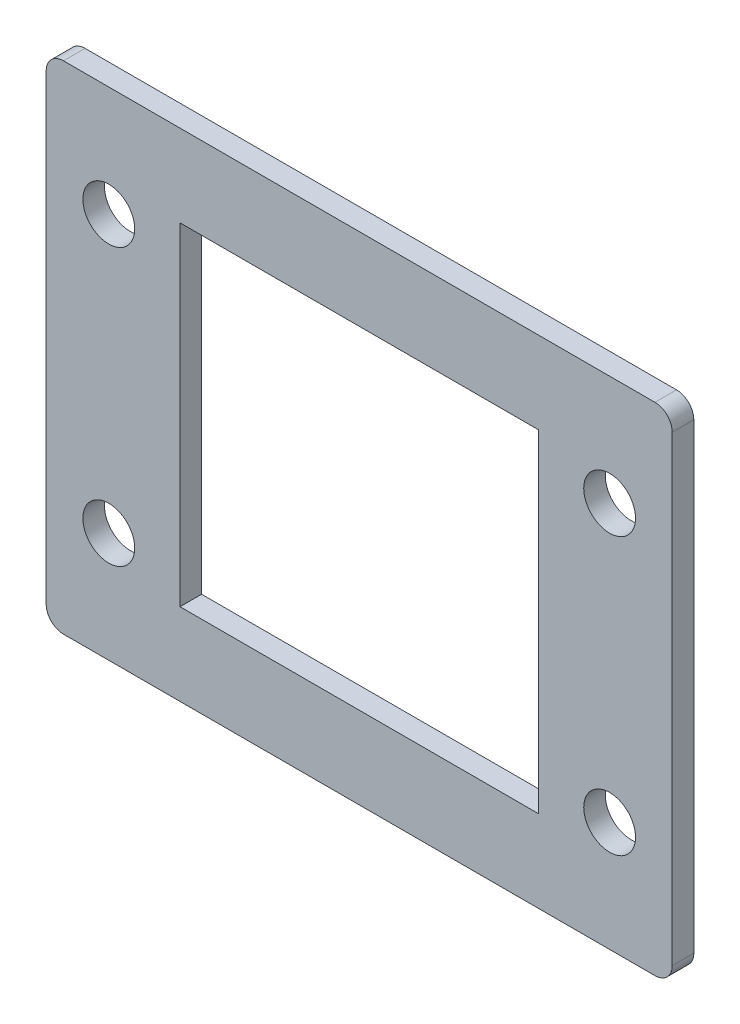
ISO-10303-21;
HEADER;
FILE_DESCRIPTION(('STEP AP214'),'2;1');
FILE_NAME('part.step','',(''),(''),'','','');
FILE_SCHEMA(('AUTOMOTIVE_DESIGN { 1 0 10303 214 1 1 1 1 }'));
ENDSEC;
DATA;
#1=APPLICATION_CONTEXT('core data for automotive mechanical design processes');
#2=APPLICATION_PROTOCOL_DEFINITION('international standard','automotive_design',2000,#1);
#3=PRODUCT_CONTEXT('',#1,'mechanical');
#4=PRODUCT('Part','Part','',(#3));
#5=PRODUCT_RELATED_PRODUCT_CATEGORY('part','',(#4));
#6=PRODUCT_DEFINITION_FORMATION('','',#4);
#7=PRODUCT_DEFINITION_CONTEXT('part definition',#1,'design');
#8=PRODUCT_DEFINITION('design','',#6,#7);
#9=PRODUCT_DEFINITION_SHAPE('','',#8);
#10=(LENGTH_UNIT() NAMED_UNIT(*) SI_UNIT(.MILLI.,.METRE.));
#11=(NAMED_UNIT(*) PLANE_ANGLE_UNIT() SI_UNIT($,.RADIAN.));
#12=(NAMED_UNIT(*) SI_UNIT($,.STERADIAN.) SOLID_ANGLE_UNIT());
#13=UNCERTAINTY_MEASURE_WITH_UNIT(LENGTH_MEASURE(1.E-05),#10,'distance_accuracy_value','');
#14=(GEOMETRIC_REPRESENTATION_CONTEXT(3) GLOBAL_UNCERTAINTY_ASSIGNED_CONTEXT((#13)) GLOBAL_UNIT_ASSIGNED_CONTEXT((#10,
#11,#12)) REPRESENTATION_CONTEXT('',''));
#15=CARTESIAN_POINT('',(0.,0.,0.));
#16=DIRECTION('',(0.,0.,1.));
#17=DIRECTION('',(1.,0.,0.));
#18=AXIS2_PLACEMENT_3D('',#15,#16,#17);
#19=CARTESIAN_POINT('',(-54.1719140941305,41.3391777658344,4.02077910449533));
#20=DIRECTION('',(0.,0.,1.));
#21=DIRECTION('',(1.,0.,0.));
#22=AXIS2_PLACEMENT_3D('',#19,#20,#21);
#23=CYLINDRICAL_SURFACE('',#22,3.);
#24=CARTESIAN_POINT('',(-54.1719140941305,41.3391777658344,12.5060604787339));
#25=DIRECTION('',(0.,0.,1.));
#26=DIRECTION('',(1.,0.,0.));
#27=AXIS2_PLACEMENT_3D('',#24,#25,#26);
#28=CIRCLE('',#27,3.);
#29=CARTESIAN_POINT('',(-51.1719140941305,41.3391777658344,12.5060604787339));
#30=VERTEX_POINT('',#29);
#31=EDGE_CURVE('E263',#30,#30,#28,.T.);
#32=ORIENTED_EDGE('',*,*,#31,.F.);
#33=EDGE_LOOP('',(#32));
#34=FACE_BOUND('',#33,.T.);
#35=CARTESIAN_POINT('',(-54.1719140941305,41.3391777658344,15.0060604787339));
#36=DIRECTION('',(0.,0.,-1.));
#37=DIRECTION('',(-1.,0.,0.));
#38=AXIS2_PLACEMENT_3D('',#35,#36,#37);
#39=CIRCLE('',#38,3.);
#40=CARTESIAN_POINT('',(-57.1719140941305,41.3391777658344,15.0060604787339));
#41=VERTEX_POINT('',#40);
#42=EDGE_CURVE('E34',#41,#41,#39,.T.);
#43=ORIENTED_EDGE('',*,*,#42,.F.);
#44=EDGE_LOOP('',(#43));
#45=FACE_BOUND('',#44,.T.);
#46=ADVANCED_FACE('F15',(#34,#45),#23,.F.);
#47=CARTESIAN_POINT('',(3.82808590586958,41.3391777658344,4.02077910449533));
#48=DIRECTION('',(0.,0.,1.));
#49=DIRECTION('',(1.,0.,0.));
#50=AXIS2_PLACEMENT_3D('',#47,#48,#49);
#51=CYLINDRICAL_SURFACE('',#50,3.);
#52=CARTESIAN_POINT('',(3.82808590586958,41.3391777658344,12.5060604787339));
#53=DIRECTION('',(0.,0.,1.));
#54=DIRECTION('',(1.,0.,0.));
#55=AXIS2_PLACEMENT_3D('',#52,#53,#54);
#56=CIRCLE('',#55,3.);
#57=CARTESIAN_POINT('',(6.82808590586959,41.3391777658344,12.5060604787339));
#58=VERTEX_POINT('',#57);
#59=EDGE_CURVE('E258',#58,#58,#56,.T.);
#60=ORIENTED_EDGE('',*,*,#59,.F.);
#61=EDGE_LOOP('',(#60));
#62=FACE_BOUND('',#61,.T.);
#63=CARTESIAN_POINT('',(3.82808590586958,41.3391777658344,15.0060604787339));
#64=DIRECTION('',(0.,0.,-1.));
#65=DIRECTION('',(-1.,0.,0.));
#66=AXIS2_PLACEMENT_3D('',#63,#64,#65);
#67=CIRCLE('',#66,3.);
#68=CARTESIAN_POINT('',(0.828085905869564,41.3391777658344,15.0060604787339));
#69=VERTEX_POINT('',#68);
#70=EDGE_CURVE('E187',#69,#69,#67,.T.);
#71=ORIENTED_EDGE('',*,*,#70,.F.);
#72=EDGE_LOOP('',(#71));
#73=FACE_BOUND('',#72,.T.);
#74=ADVANCED_FACE('F293',(#62,#73),#51,.F.);
#75=CARTESIAN_POINT('',(-59.4219140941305,52.0891777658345,12.5060604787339));
#76=DIRECTION('',(0.,0.,1.));
#77=DIRECTION('',(1.,0.,0.));
#78=AXIS2_PLACEMENT_3D('',#75,#76,#77);
#79=CYLINDRICAL_SURFACE('',#78,2.);
#80=CARTESIAN_POINT('',(-59.4219140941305,52.0891777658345,12.5060604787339));
#81=DIRECTION('',(0.,0.,-1.));
#82=DIRECTION('',(1.,0.,0.));
#83=AXIS2_PLACEMENT_3D('',#80,#81,#82);
#84=CIRCLE('',#83,2.);
#85=CARTESIAN_POINT('',(-61.4219140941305,52.0891777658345,12.5060604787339));
#86=VERTEX_POINT('',#85);
#87=CARTESIAN_POINT('',(-59.4219140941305,54.0891777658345,12.5060604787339));
#88=VERTEX_POINT('',#87);
#89=EDGE_CURVE('E244',#86,#88,#84,.T.);
#90=ORIENTED_EDGE('',*,*,#89,.F.);
#91=DIRECTION('',(0.,0.,-1.));
#92=VECTOR('',#91,1.);
#93=CARTESIAN_POINT('',(-61.4219140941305,52.0891777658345,12.5060604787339));
#94=LINE('',#93,#92);
#95=CARTESIAN_POINT('',(-61.4219140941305,52.0891777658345,15.0060604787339));
#96=VERTEX_POINT('',#95);
#97=EDGE_CURVE('E215',#96,#86,#94,.T.);
#98=ORIENTED_EDGE('',*,*,#97,.F.);
#99=CARTESIAN_POINT('',(-59.4219140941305,52.0891777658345,15.0060604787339));
#100=DIRECTION('',(0.,0.,1.));
#101=DIRECTION('',(1.,0.,0.));
#102=AXIS2_PLACEMENT_3D('',#99,#100,#101);
#103=CIRCLE('',#102,2.);
#104=CARTESIAN_POINT('',(-59.4219140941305,54.0891777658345,15.0060604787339));
#105=VERTEX_POINT('',#104);
#106=EDGE_CURVE('E270',#105,#96,#103,.T.);
#107=ORIENTED_EDGE('',*,*,#106,.F.);
#108=DIRECTION('',(0.,0.,1.));
#109=VECTOR('',#108,1.);
#110=CARTESIAN_POINT('',(-59.4219140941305,54.0891777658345,12.5060604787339));
#111=LINE('',#110,#109);
#112=EDGE_CURVE('E221',#88,#105,#111,.T.);
#113=ORIENTED_EDGE('',*,*,#112,.F.);
#114=EDGE_LOOP('',(#90,#98,#107,#113));
#115=FACE_BOUND('',#114,.T.);
#116=ADVANCED_FACE('F295',(#115),#79,.T.);
#117=CARTESIAN_POINT('',(-59.4219140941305,-1.41082223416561,12.5060604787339));
#118=DIRECTION('',(0.,0.,1.));
#119=DIRECTION('',(1.,0.,0.));
#120=AXIS2_PLACEMENT_3D('',#117,#118,#119);
#121=CYLINDRICAL_SURFACE('',#120,2.);
#122=CARTESIAN_POINT('',(-59.4219140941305,-1.41082223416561,12.5060604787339));
#123=DIRECTION('',(0.,0.,-1.));
#124=DIRECTION('',(1.,0.,0.));
#125=AXIS2_PLACEMENT_3D('',#122,#123,#124);
#126=CIRCLE('',#125,2.);
#127=CARTESIAN_POINT('',(-59.4219140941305,-3.41082223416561,12.5060604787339));
#128=VERTEX_POINT('',#127);
#129=CARTESIAN_POINT('',(-61.4219140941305,-1.41082223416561,12.5060604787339));
#130=VERTEX_POINT('',#129);
#131=EDGE_CURVE('E530',#128,#130,#126,.T.);
#132=ORIENTED_EDGE('',*,*,#131,.F.);
#133=DIRECTION('',(0.,0.,-1.));
#134=VECTOR('',#133,1.);
#135=CARTESIAN_POINT('',(-59.4219140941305,-3.41082223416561,12.5060604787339));
#136=LINE('',#135,#134);
#137=CARTESIAN_POINT('',(-59.4219140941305,-3.41082223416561,15.0060604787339));
#138=VERTEX_POINT('',#137);
#139=EDGE_CURVE('E209',#138,#128,#136,.T.);
#140=ORIENTED_EDGE('',*,*,#139,.F.);
#141=CARTESIAN_POINT('',(-59.4219140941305,-1.41082223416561,15.0060604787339));
#142=DIRECTION('',(0.,0.,1.));
#143=DIRECTION('',(1.,0.,0.));
#144=AXIS2_PLACEMENT_3D('',#141,#142,#143);
#145=CIRCLE('',#144,2.);
#146=CARTESIAN_POINT('',(-61.4219140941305,-1.41082223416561,15.0060604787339));
#147=VERTEX_POINT('',#146);
#148=EDGE_CURVE('E276',#147,#138,#145,.T.);
#149=ORIENTED_EDGE('',*,*,#148,.F.);
#150=DIRECTION('',(0.,0.,1.));
#151=VECTOR('',#150,1.);
#152=CARTESIAN_POINT('',(-61.4219140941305,-1.41082223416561,12.5060604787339));
#153=LINE('',#152,#151);
#154=EDGE_CURVE('E212',#130,#147,#153,.T.);
#155=ORIENTED_EDGE('',*,*,#154,.F.);
#156=EDGE_LOOP('',(#132,#140,#149,#155));
#157=FACE_BOUND('',#156,.T.);
#158=ADVANCED_FACE('F302',(#157),#121,.T.);
#159=CARTESIAN_POINT('',(9.0780859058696,-1.41082223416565,12.5060604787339));
#160=DIRECTION('',(0.,0.,1.));
#161=DIRECTION('',(1.,0.,0.));
#162=AXIS2_PLACEMENT_3D('',#159,#160,#161);
#163=CYLINDRICAL_SURFACE('',#162,2.);
#164=CARTESIAN_POINT('',(9.0780859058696,-1.41082223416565,12.5060604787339));
#165=DIRECTION('',(0.,0.,-1.));
#166=DIRECTION('',(1.,0.,0.));
#167=AXIS2_PLACEMENT_3D('',#164,#165,#166);
#168=CIRCLE('',#167,2.);
#169=CARTESIAN_POINT('',(11.0780859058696,-1.41082223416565,12.5060604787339));
#170=VERTEX_POINT('',#169);
#171=CARTESIAN_POINT('',(9.0780859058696,-3.41082223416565,12.5060604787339));
#172=VERTEX_POINT('',#171);
#173=EDGE_CURVE('E540',#170,#172,#168,.T.);
#174=ORIENTED_EDGE('',*,*,#173,.F.);
#175=DIRECTION('',(0.,0.,-1.));
#176=VECTOR('',#175,1.);
#177=CARTESIAN_POINT('',(11.0780859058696,-1.41082223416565,12.5060604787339));
#178=LINE('',#177,#176);
#179=CARTESIAN_POINT('',(11.0780859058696,-1.41082223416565,15.0060604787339));
#180=VERTEX_POINT('',#179);
#181=EDGE_CURVE('E203',#180,#170,#178,.T.);
#182=ORIENTED_EDGE('',*,*,#181,.F.);
#183=CARTESIAN_POINT('',(9.0780859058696,-1.41082223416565,15.0060604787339));
#184=DIRECTION('',(0.,0.,1.));
#185=DIRECTION('',(1.,0.,0.));
#186=AXIS2_PLACEMENT_3D('',#183,#184,#185);
#187=CIRCLE('',#186,2.);
#188=CARTESIAN_POINT('',(9.0780859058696,-3.41082223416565,15.0060604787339));
#189=VERTEX_POINT('',#188);
#190=EDGE_CURVE('E284',#189,#180,#187,.T.);
#191=ORIENTED_EDGE('',*,*,#190,.F.);
#192=DIRECTION('',(0.,0.,1.));
#193=VECTOR('',#192,1.);
#194=CARTESIAN_POINT('',(9.0780859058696,-3.41082223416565,12.5060604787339));
#195=LINE('',#194,#193);
#196=EDGE_CURVE('E206',#172,#189,#195,.T.);
#197=ORIENTED_EDGE('',*,*,#196,.F.);
#198=EDGE_LOOP('',(#174,#182,#191,#197));
#199=FACE_BOUND('',#198,.T.);
#200=ADVANCED_FACE('F310',(#199),#163,.T.);
#201=CARTESIAN_POINT('',(9.07808590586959,52.0891777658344,12.5060604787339));
#202=DIRECTION('',(0.,0.,1.));
#203=DIRECTION('',(1.,0.,0.));
#204=AXIS2_PLACEMENT_3D('',#201,#202,#203);
#205=CYLINDRICAL_SURFACE('',#204,2.);
#206=CARTESIAN_POINT('',(9.07808590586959,52.0891777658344,12.5060604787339));
#207=DIRECTION('',(0.,0.,-1.));
#208=DIRECTION('',(1.,0.,0.));
#209=AXIS2_PLACEMENT_3D('',#206,#207,#208);
#210=CIRCLE('',#209,2.);
#211=CARTESIAN_POINT('',(9.07808590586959,54.0891777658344,12.5060604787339));
#212=VERTEX_POINT('',#211);
#213=CARTESIAN_POINT('',(11.0780859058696,52.0891777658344,12.5060604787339));
#214=VERTEX_POINT('',#213);
#215=EDGE_CURVE('E522',#212,#214,#210,.T.);
#216=ORIENTED_EDGE('',*,*,#215,.F.);
#217=DIRECTION('',(0.,0.,-1.));
#218=VECTOR('',#217,1.);
#219=CARTESIAN_POINT('',(9.07808590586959,54.0891777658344,12.5060604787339));
#220=LINE('',#219,#218);
#221=CARTESIAN_POINT('',(9.07808590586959,54.0891777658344,15.0060604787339));
#222=VERTEX_POINT('',#221);
#223=EDGE_CURVE('E218',#222,#212,#220,.T.);
#224=ORIENTED_EDGE('',*,*,#223,.F.);
#225=CARTESIAN_POINT('',(9.07808590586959,52.0891777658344,15.0060604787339));
#226=DIRECTION('',(0.,0.,1.));
#227=DIRECTION('',(1.,0.,0.));
#228=AXIS2_PLACEMENT_3D('',#225,#226,#227);
#229=CIRCLE('',#228,2.);
#230=CARTESIAN_POINT('',(11.0780859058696,52.0891777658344,15.0060604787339));
#231=VERTEX_POINT('',#230);
#232=EDGE_CURVE('E271',#231,#222,#229,.T.);
#233=ORIENTED_EDGE('',*,*,#232,.F.);
#234=DIRECTION('',(0.,0.,1.));
#235=VECTOR('',#234,1.);
#236=CARTESIAN_POINT('',(11.0780859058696,52.0891777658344,12.5060604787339));
#237=LINE('',#236,#235);
#238=EDGE_CURVE('E200',#214,#231,#237,.T.);
#239=ORIENTED_EDGE('',*,*,#238,.F.);
#240=EDGE_LOOP('',(#216,#224,#233,#239));
#241=FACE_BOUND('',#240,.T.);
#242=ADVANCED_FACE('F314',(#241),#205,.T.);
#243=CARTESIAN_POINT('',(-54.1719140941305,9.3391777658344,-44.1022427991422));
#244=DIRECTION('',(0.,0.,1.));
#245=DIRECTION('',(1.,0.,0.));
#246=AXIS2_PLACEMENT_3D('',#243,#244,#245);
#247=CYLINDRICAL_SURFACE('',#246,3.);
#248=CARTESIAN_POINT('',(-54.1719140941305,9.3391777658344,12.5060604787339));
#249=DIRECTION('',(0.,0.,1.));
#250=DIRECTION('',(1.,0.,0.));
#251=AXIS2_PLACEMENT_3D('',#248,#249,#250);
#252=CIRCLE('',#251,3.);
#253=CARTESIAN_POINT('',(-51.1719140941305,9.3391777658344,12.5060604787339));
#254=VERTEX_POINT('',#253);
#255=EDGE_CURVE('E255',#254,#254,#252,.T.);
#256=ORIENTED_EDGE('',*,*,#255,.F.);
#257=EDGE_LOOP('',(#256));
#258=FACE_BOUND('',#257,.T.);
#259=CARTESIAN_POINT('',(-54.1719140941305,9.3391777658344,15.0060604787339));
#260=DIRECTION('',(0.,0.,-1.));
#261=DIRECTION('',(1.,0.,0.));
#262=AXIS2_PLACEMENT_3D('',#259,#260,#261);
#263=CIRCLE('',#262,3.);
#264=CARTESIAN_POINT('',(-51.1719140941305,9.3391777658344,15.0060604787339));
#265=VERTEX_POINT('',#264);
#266=EDGE_CURVE('E195',#265,#265,#263,.T.);
#267=ORIENTED_EDGE('',*,*,#266,.F.);
#268=EDGE_LOOP('',(#267));
#269=FACE_BOUND('',#268,.T.);
#270=ADVANCED_FACE('F318',(#258,#269),#247,.F.);
#271=CARTESIAN_POINT('',(3.82808590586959,9.33917776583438,-44.1022427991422));
#272=DIRECTION('',(0.,0.,1.));
#273=DIRECTION('',(1.,0.,0.));
#274=AXIS2_PLACEMENT_3D('',#271,#272,#273);
#275=CYLINDRICAL_SURFACE('',#274,3.);
#276=CARTESIAN_POINT('',(3.82808590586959,9.33917776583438,12.5060604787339));
#277=DIRECTION('',(0.,0.,1.));
#278=DIRECTION('',(1.,0.,0.));
#279=AXIS2_PLACEMENT_3D('',#276,#277,#278);
#280=CIRCLE('',#279,3.);
#281=CARTESIAN_POINT('',(6.82808590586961,9.33917776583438,12.5060604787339));
#282=VERTEX_POINT('',#281);
#283=EDGE_CURVE('E252',#282,#282,#280,.T.);
#284=ORIENTED_EDGE('',*,*,#283,.F.);
#285=EDGE_LOOP('',(#284));
#286=FACE_BOUND('',#285,.T.);
#287=CARTESIAN_POINT('',(3.82808590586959,9.33917776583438,15.0060604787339));
#288=DIRECTION('',(0.,0.,-1.));
#289=DIRECTION('',(-1.,0.,0.));
#290=AXIS2_PLACEMENT_3D('',#287,#288,#289);
#291=CIRCLE('',#290,3.);
#292=CARTESIAN_POINT('',(0.828085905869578,9.33917776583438,15.0060604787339));
#293=VERTEX_POINT('',#292);
#294=EDGE_CURVE('E183',#293,#293,#291,.T.);
#295=ORIENTED_EDGE('',*,*,#294,.F.);
#296=EDGE_LOOP('',(#295));
#297=FACE_BOUND('',#296,.T.);
#298=ADVANCED_FACE('F322',(#286,#297),#275,.F.);
#299=CARTESIAN_POINT('',(-4.42191409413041,6.08917776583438,-44.1022427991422));
#300=DIRECTION('',(-1.,0.,0.));
#301=DIRECTION('',(0.,-1.,0.));
#302=AXIS2_PLACEMENT_3D('',#299,#300,#301);
#303=PLANE('',#302);
#304=DIRECTION('',(0.,0.,1.));
#305=VECTOR('',#304,1.);
#306=CARTESIAN_POINT('',(-4.42191409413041,6.08917776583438,-44.1022427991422));
#307=LINE('',#306,#305);
#308=CARTESIAN_POINT('',(-4.42191409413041,6.08917776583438,12.5060604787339));
#309=VERTEX_POINT('',#308);
#310=CARTESIAN_POINT('',(-4.42191409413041,6.08917776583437,15.0060604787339));
#311=VERTEX_POINT('',#310);
#312=EDGE_CURVE('E10',#309,#311,#307,.T.);
#313=ORIENTED_EDGE('',*,*,#312,.T.);
#314=DIRECTION('',(0.,-1.,0.));
#315=VECTOR('',#314,1.);
#316=CARTESIAN_POINT('',(-4.42191409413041,6.08917776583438,15.0060604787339));
#317=LINE('',#316,#315);
#318=CARTESIAN_POINT('',(-4.42191409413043,44.5891777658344,15.0060604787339));
#319=VERTEX_POINT('',#318);
#320=EDGE_CURVE('E175',#319,#311,#317,.T.);
#321=ORIENTED_EDGE('',*,*,#320,.F.);
#322=DIRECTION('',(0.,0.,1.));
#323=VECTOR('',#322,1.);
#324=CARTESIAN_POINT('',(-4.42191409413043,44.5891777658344,-44.1022427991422));
#325=LINE('',#324,#323);
#326=CARTESIAN_POINT('',(-4.42191409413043,44.5891777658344,12.5060604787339));
#327=VERTEX_POINT('',#326);
#328=EDGE_CURVE('E165',#327,#319,#325,.T.);
#329=ORIENTED_EDGE('',*,*,#328,.F.);
#330=DIRECTION('',(0.,1.,0.));
#331=VECTOR('',#330,1.);
#332=CARTESIAN_POINT('',(-4.42191409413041,6.08917776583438,12.5060604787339));
#333=LINE('',#332,#331);
#334=EDGE_CURVE('E234',#309,#327,#333,.T.);
#335=ORIENTED_EDGE('',*,*,#334,.F.);
#336=EDGE_LOOP('',(#313,#321,#329,#335));
#337=FACE_BOUND('',#336,.T.);
#338=ADVANCED_FACE('F326',(#337),#303,.T.);
#339=CARTESIAN_POINT('',(-4.42191409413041,6.08917776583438,-44.1022427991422));
#340=DIRECTION('',(0.,1.,0.));
#341=DIRECTION('',(-1.,0.,0.));
#342=AXIS2_PLACEMENT_3D('',#339,#340,#341);
#343=PLANE('',#342);
#344=DIRECTION('',(0.,0.,1.));
#345=VECTOR('',#344,1.);
#346=CARTESIAN_POINT('',(-45.9219140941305,6.0891777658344,-44.1022427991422));
#347=LINE('',#346,#345);
#348=CARTESIAN_POINT('',(-45.9219140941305,6.0891777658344,12.5060604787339));
#349=VERTEX_POINT('',#348);
#350=CARTESIAN_POINT('',(-45.9219140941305,6.0891777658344,15.0060604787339));
#351=VERTEX_POINT('',#350);
#352=EDGE_CURVE('E24',#349,#351,#347,.T.);
#353=ORIENTED_EDGE('',*,*,#352,.T.);
#354=DIRECTION('',(-1.,0.,0.));
#355=VECTOR('',#354,1.);
#356=CARTESIAN_POINT('',(-4.42191409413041,6.08917776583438,15.0060604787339));
#357=LINE('',#356,#355);
#358=EDGE_CURVE('E181',#311,#351,#357,.T.);
#359=ORIENTED_EDGE('',*,*,#358,.F.);
#360=ORIENTED_EDGE('',*,*,#312,.F.);
#361=DIRECTION('',(1.,0.,0.));
#362=VECTOR('',#361,1.);
#363=CARTESIAN_POINT('',(-4.42191409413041,6.08917776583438,12.5060604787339));
#364=LINE('',#363,#362);
#365=EDGE_CURVE('E229',#349,#309,#364,.T.);
#366=ORIENTED_EDGE('',*,*,#365,.F.);
#367=EDGE_LOOP('',(#353,#359,#360,#366));
#368=FACE_BOUND('',#367,.T.);
#369=ADVANCED_FACE('F227',(#368),#343,.T.);
#370=CARTESIAN_POINT('',(-45.9219140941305,6.0891777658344,-44.1022427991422));
#371=DIRECTION('',(1.,0.,0.));
#372=DIRECTION('',(0.,0.,-1.));
#373=AXIS2_PLACEMENT_3D('',#370,#371,#372);
#374=PLANE('',#373);
#375=DIRECTION('',(0.,0.,1.));
#376=VECTOR('',#375,1.);
#377=CARTESIAN_POINT('',(-45.9219140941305,44.5891777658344,-44.1022427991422));
#378=LINE('',#377,#376);
#379=CARTESIAN_POINT('',(-45.9219140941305,44.5891777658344,12.5060604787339));
#380=VERTEX_POINT('',#379);
#381=CARTESIAN_POINT('',(-45.9219140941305,44.5891777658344,15.0060604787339));
#382=VERTEX_POINT('',#381);
#383=EDGE_CURVE('E154',#380,#382,#378,.T.);
#384=ORIENTED_EDGE('',*,*,#383,.T.);
#385=DIRECTION('',(0.,1.,0.));
#386=VECTOR('',#385,1.);
#387=CARTESIAN_POINT('',(-45.9219140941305,6.0891777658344,15.0060604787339));
#388=LINE('',#387,#386);
#389=EDGE_CURVE('E158',#351,#382,#388,.T.);
#390=ORIENTED_EDGE('',*,*,#389,.F.);
#391=ORIENTED_EDGE('',*,*,#352,.F.);
#392=DIRECTION('',(0.,-1.,0.));
#393=VECTOR('',#392,1.);
#394=CARTESIAN_POINT('',(-45.9219140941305,6.0891777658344,12.5060604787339));
#395=LINE('',#394,#393);
#396=EDGE_CURVE('E160',#380,#349,#395,.T.);
#397=ORIENTED_EDGE('',*,*,#396,.F.);
#398=EDGE_LOOP('',(#384,#390,#391,#397));
#399=FACE_BOUND('',#398,.T.);
#400=ADVANCED_FACE('F156',(#399),#374,.T.);
#401=CARTESIAN_POINT('',(-4.42191409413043,44.5891777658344,-44.1022427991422));
#402=DIRECTION('',(0.,-1.,0.));
#403=DIRECTION('',(1.,0.,0.));
#404=AXIS2_PLACEMENT_3D('',#401,#402,#403);
#405=PLANE('',#404);
#406=ORIENTED_EDGE('',*,*,#328,.T.);
#407=DIRECTION('',(1.,0.,0.));
#408=VECTOR('',#407,1.);
#409=CARTESIAN_POINT('',(-4.42191409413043,44.5891777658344,15.0060604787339));
#410=LINE('',#409,#408);
#411=EDGE_CURVE('E168',#382,#319,#410,.T.);
#412=ORIENTED_EDGE('',*,*,#411,.F.);
#413=ORIENTED_EDGE('',*,*,#383,.F.);
#414=DIRECTION('',(-1.,0.,0.));
#415=VECTOR('',#414,1.);
#416=CARTESIAN_POINT('',(-4.42191409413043,44.5891777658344,12.5060604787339));
#417=LINE('',#416,#415);
#418=EDGE_CURVE('E238',#327,#380,#417,.T.);
#419=ORIENTED_EDGE('',*,*,#418,.F.);
#420=EDGE_LOOP('',(#406,#412,#413,#419));
#421=FACE_BOUND('',#420,.T.);
#422=ADVANCED_FACE('F169',(#421),#405,.T.);
#423=CARTESIAN_POINT('',(11.0780859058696,54.0891777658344,12.5060604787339));
#424=DIRECTION('',(0.,-1.,0.));
#425=DIRECTION('',(1.,0.,0.));
#426=AXIS2_PLACEMENT_3D('',#423,#424,#425);
#427=PLANE('',#426);
#428=DIRECTION('',(1.,0.,0.));
#429=VECTOR('',#428,1.);
#430=CARTESIAN_POINT('',(11.0780859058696,54.0891777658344,15.0060604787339));
#431=LINE('',#430,#429);
#432=EDGE_CURVE('E266',#105,#222,#431,.T.);
#433=ORIENTED_EDGE('',*,*,#432,.T.);
#434=ORIENTED_EDGE('',*,*,#223,.T.);
#435=DIRECTION('',(1.,0.,0.));
#436=VECTOR('',#435,1.);
#437=CARTESIAN_POINT('',(11.0780859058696,54.0891777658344,12.5060604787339));
#438=LINE('',#437,#436);
#439=EDGE_CURVE('E514',#88,#212,#438,.T.);
#440=ORIENTED_EDGE('',*,*,#439,.F.);
#441=ORIENTED_EDGE('',*,*,#112,.T.);
#442=EDGE_LOOP('',(#433,#434,#440,#441));
#443=FACE_BOUND('',#442,.T.);
#444=ADVANCED_FACE('F337',(#443),#427,.F.);
#445=CARTESIAN_POINT('',(-61.4219140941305,-3.41082223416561,12.5060604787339));
#446=DIRECTION('',(1.,0.,0.));
#447=DIRECTION('',(0.,1.,0.));
#448=AXIS2_PLACEMENT_3D('',#445,#446,#447);
#449=PLANE('',#448);
#450=DIRECTION('',(0.,1.,0.));
#451=VECTOR('',#450,1.);
#452=CARTESIAN_POINT('',(-61.4219140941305,-3.41082223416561,12.5060604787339));
#453=LINE('',#452,#451);
#454=EDGE_CURVE('E517',#130,#86,#453,.T.);
#455=ORIENTED_EDGE('',*,*,#454,.F.);
#456=ORIENTED_EDGE('',*,*,#154,.T.);
#457=DIRECTION('',(0.,1.,0.));
#458=VECTOR('',#457,1.);
#459=CARTESIAN_POINT('',(-61.4219140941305,-3.41082223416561,15.0060604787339));
#460=LINE('',#459,#458);
#461=EDGE_CURVE('E275',#147,#96,#460,.T.);
#462=ORIENTED_EDGE('',*,*,#461,.T.);
#463=ORIENTED_EDGE('',*,*,#97,.T.);
#464=EDGE_LOOP('',(#455,#456,#462,#463));
#465=FACE_BOUND('',#464,.T.);
#466=ADVANCED_FACE('F335',(#465),#449,.F.);
#467=CARTESIAN_POINT('',(11.0780859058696,-3.41082223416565,12.5060604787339));
#468=DIRECTION('',(0.,1.,0.));
#469=DIRECTION('',(-1.,0.,0.));
#470=AXIS2_PLACEMENT_3D('',#467,#468,#469);
#471=PLANE('',#470);
#472=DIRECTION('',(-1.,0.,0.));
#473=VECTOR('',#472,1.);
#474=CARTESIAN_POINT('',(11.0780859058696,-3.41082223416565,12.5060604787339));
#475=LINE('',#474,#473);
#476=EDGE_CURVE('E531',#172,#128,#475,.T.);
#477=ORIENTED_EDGE('',*,*,#476,.F.);
#478=ORIENTED_EDGE('',*,*,#196,.T.);
#479=DIRECTION('',(-1.,0.,0.));
#480=VECTOR('',#479,1.);
#481=CARTESIAN_POINT('',(11.0780859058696,-3.41082223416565,15.0060604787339));
#482=LINE('',#481,#480);
#483=EDGE_CURVE('E280',#189,#138,#482,.T.);
#484=ORIENTED_EDGE('',*,*,#483,.T.);
#485=ORIENTED_EDGE('',*,*,#139,.T.);
#486=EDGE_LOOP('',(#477,#478,#484,#485));
#487=FACE_BOUND('',#486,.T.);
#488=ADVANCED_FACE('F331',(#487),#471,.F.);
#489=CARTESIAN_POINT('',(11.0780859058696,-3.41082223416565,12.5060604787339));
#490=DIRECTION('',(-1.,0.,0.));
#491=DIRECTION('',(0.,1.,0.));
#492=AXIS2_PLACEMENT_3D('',#489,#490,#491);
#493=PLANE('',#492);
#494=DIRECTION('',(0.,-1.,0.));
#495=VECTOR('',#494,1.);
#496=CARTESIAN_POINT('',(11.0780859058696,-3.41082223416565,12.5060604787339));
#497=LINE('',#496,#495);
#498=EDGE_CURVE('E527',#214,#170,#497,.T.);
#499=ORIENTED_EDGE('',*,*,#498,.F.);
#500=ORIENTED_EDGE('',*,*,#238,.T.);
#501=DIRECTION('',(0.,-1.,0.));
#502=VECTOR('',#501,1.);
#503=CARTESIAN_POINT('',(11.0780859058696,-3.41082223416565,15.0060604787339));
#504=LINE('',#503,#502);
#505=EDGE_CURVE('E247',#231,#180,#504,.T.);
#506=ORIENTED_EDGE('',*,*,#505,.T.);
#507=ORIENTED_EDGE('',*,*,#181,.T.);
#508=EDGE_LOOP('',(#499,#500,#506,#507));
#509=FACE_BOUND('',#508,.T.);
#510=ADVANCED_FACE('F334',(#509),#493,.F.);
#511=CARTESIAN_POINT('',(11.0780859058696,54.0891777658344,15.0060604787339));
#512=DIRECTION('',(0.,0.,1.));
#513=DIRECTION('',(0.,-1.,0.));
#514=AXIS2_PLACEMENT_3D('',#511,#512,#513);
#515=PLANE('',#514);
#516=ORIENTED_EDGE('',*,*,#42,.T.);
#517=EDGE_LOOP('',(#516));
#518=FACE_BOUND('',#517,.T.);
#519=ORIENTED_EDGE('',*,*,#266,.T.);
#520=EDGE_LOOP('',(#519));
#521=FACE_BOUND('',#520,.T.);
#522=ORIENTED_EDGE('',*,*,#389,.T.);
#523=ORIENTED_EDGE('',*,*,#411,.T.);
#524=ORIENTED_EDGE('',*,*,#320,.T.);
#525=ORIENTED_EDGE('',*,*,#358,.T.);
#526=EDGE_LOOP('',(#522,#523,#524,#525));
#527=FACE_BOUND('',#526,.T.);
#528=ORIENTED_EDGE('',*,*,#294,.T.);
#529=EDGE_LOOP('',(#528));
#530=FACE_BOUND('',#529,.T.);
#531=ORIENTED_EDGE('',*,*,#70,.T.);
#532=EDGE_LOOP('',(#531));
#533=FACE_BOUND('',#532,.T.);
#534=ORIENTED_EDGE('',*,*,#505,.F.);
#535=ORIENTED_EDGE('',*,*,#232,.T.);
#536=ORIENTED_EDGE('',*,*,#432,.F.);
#537=ORIENTED_EDGE('',*,*,#106,.T.);
#538=ORIENTED_EDGE('',*,*,#461,.F.);
#539=ORIENTED_EDGE('',*,*,#148,.T.);
#540=ORIENTED_EDGE('',*,*,#483,.F.);
#541=ORIENTED_EDGE('',*,*,#190,.T.);
#542=EDGE_LOOP('',(#534,#535,#536,#537,#538,#539,#540,#541));
#543=FACE_BOUND('',#542,.T.);
#544=ADVANCED_FACE('F178',(#518,#521,#527,#530,#533,#543),#515,.T.);
#545=CARTESIAN_POINT('',(11.0780859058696,54.0891777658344,12.5060604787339));
#546=DIRECTION('',(0.,0.,1.));
#547=DIRECTION('',(0.,-1.,0.));
#548=AXIS2_PLACEMENT_3D('',#545,#546,#547);
#549=PLANE('',#548);
#550=ORIENTED_EDGE('',*,*,#31,.T.);
#551=EDGE_LOOP('',(#550));
#552=FACE_BOUND('',#551,.T.);
#553=ORIENTED_EDGE('',*,*,#59,.T.);
#554=EDGE_LOOP('',(#553));
#555=FACE_BOUND('',#554,.T.);
#556=ORIENTED_EDGE('',*,*,#255,.T.);
#557=EDGE_LOOP('',(#556));
#558=FACE_BOUND('',#557,.T.);
#559=ORIENTED_EDGE('',*,*,#283,.T.);
#560=EDGE_LOOP('',(#559));
#561=FACE_BOUND('',#560,.T.);
#562=ORIENTED_EDGE('',*,*,#418,.T.);
#563=ORIENTED_EDGE('',*,*,#396,.T.);
#564=ORIENTED_EDGE('',*,*,#365,.T.);
#565=ORIENTED_EDGE('',*,*,#334,.T.);
#566=EDGE_LOOP('',(#562,#563,#564,#565));
#567=FACE_BOUND('',#566,.T.);
#568=ORIENTED_EDGE('',*,*,#439,.T.);
#569=ORIENTED_EDGE('',*,*,#215,.T.);
#570=ORIENTED_EDGE('',*,*,#498,.T.);
#571=ORIENTED_EDGE('',*,*,#173,.T.);
#572=ORIENTED_EDGE('',*,*,#476,.T.);
#573=ORIENTED_EDGE('',*,*,#131,.T.);
#574=ORIENTED_EDGE('',*,*,#454,.T.);
#575=ORIENTED_EDGE('',*,*,#89,.T.);
#576=EDGE_LOOP('',(#568,#569,#570,#571,#572,#573,#574,#575));
#577=FACE_BOUND('',#576,.T.);
#578=ADVANCED_FACE('F236',(#552,#555,#558,#561,#567,#577),#549,.F.);
#579=CLOSED_SHELL('',(#46,#74,#116,#158,#200,#242,#270,#298,#338,#369,#400,#422,#444,#466,#488,
#510,#544,#578));
#580=MANIFOLD_SOLID_BREP('B1',#579);
#581=ADVANCED_BREP_SHAPE_REPRESENTATION('',(#18,#580),#14);
#582=SHAPE_DEFINITION_REPRESENTATION(#9,#581);
ENDSEC;
END-ISO-10303-21;
